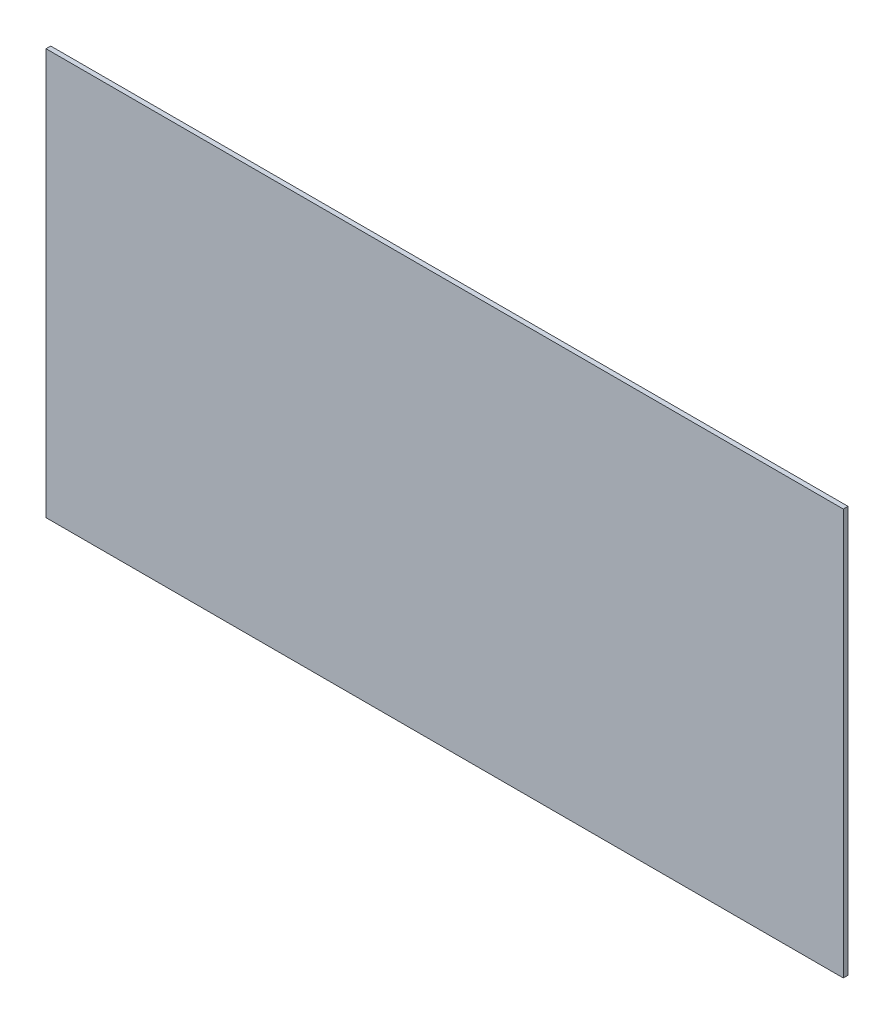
ISO-10303-21;
HEADER;
FILE_DESCRIPTION(('STEP AP214'),'2;1');
FILE_NAME('part.step','',(''),(''),'','','');
FILE_SCHEMA(('AUTOMOTIVE_DESIGN { 1 0 10303 214 1 1 1 1 }'));
ENDSEC;
DATA;
#1=APPLICATION_CONTEXT('core data for automotive mechanical design processes');
#2=APPLICATION_PROTOCOL_DEFINITION('international standard','automotive_design',2000,#1);
#3=PRODUCT_CONTEXT('',#1,'mechanical');
#4=PRODUCT('Part','Part','',(#3));
#5=PRODUCT_RELATED_PRODUCT_CATEGORY('part','',(#4));
#6=PRODUCT_DEFINITION_FORMATION('','',#4);
#7=PRODUCT_DEFINITION_CONTEXT('part definition',#1,'design');
#8=PRODUCT_DEFINITION('design','',#6,#7);
#9=PRODUCT_DEFINITION_SHAPE('','',#8);
#10=(LENGTH_UNIT() NAMED_UNIT(*) SI_UNIT(.MILLI.,.METRE.));
#11=(NAMED_UNIT(*) PLANE_ANGLE_UNIT() SI_UNIT($,.RADIAN.));
#12=(NAMED_UNIT(*) SI_UNIT($,.STERADIAN.) SOLID_ANGLE_UNIT());
#13=UNCERTAINTY_MEASURE_WITH_UNIT(LENGTH_MEASURE(1.E-05),#10,'distance_accuracy_value','');
#14=(GEOMETRIC_REPRESENTATION_CONTEXT(3) GLOBAL_UNCERTAINTY_ASSIGNED_CONTEXT((#13)) GLOBAL_UNIT_ASSIGNED_CONTEXT((#10,
#11,#12)) REPRESENTATION_CONTEXT('',''));
#15=CARTESIAN_POINT('',(0.,0.,0.));
#16=DIRECTION('',(0.,0.,1.));
#17=DIRECTION('',(1.,0.,0.));
#18=AXIS2_PLACEMENT_3D('',#15,#16,#17);
#19=CARTESIAN_POINT('',(-254.8,-129.8,3.));
#20=DIRECTION('',(0.,1.,0.));
#21=DIRECTION('',(0.,0.,1.));
#22=AXIS2_PLACEMENT_3D('',#19,#20,#21);
#23=PLANE('',#22);
#24=DIRECTION('',(1.,0.,0.));
#25=VECTOR('',#24,1.);
#26=CARTESIAN_POINT('',(-254.8,-129.8,0.));
#27=LINE('',#26,#25);
#28=CARTESIAN_POINT('',(-254.8,-129.8,0.));
#29=VERTEX_POINT('',#28);
#30=CARTESIAN_POINT('',(254.8,-129.8,0.));
#31=VERTEX_POINT('',#30);
#32=EDGE_CURVE('E96',#29,#31,#27,.T.);
#33=ORIENTED_EDGE('',*,*,#32,.T.);
#34=DIRECTION('',(0.,0.,-1.));
#35=VECTOR('',#34,1.);
#36=CARTESIAN_POINT('',(254.8,-129.8,3.));
#37=LINE('',#36,#35);
#38=CARTESIAN_POINT('',(254.8,-129.8,3.));
#39=VERTEX_POINT('',#38);
#40=EDGE_CURVE('E11',#39,#31,#37,.T.);
#41=ORIENTED_EDGE('',*,*,#40,.F.);
#42=DIRECTION('',(1.,0.,0.));
#43=VECTOR('',#42,1.);
#44=CARTESIAN_POINT('',(-254.8,-129.8,3.));
#45=LINE('',#44,#43);
#46=CARTESIAN_POINT('',(-254.8,-129.8,3.));
#47=VERTEX_POINT('',#46);
#48=EDGE_CURVE('E82',#47,#39,#45,.T.);
#49=ORIENTED_EDGE('',*,*,#48,.F.);
#50=DIRECTION('',(0.,0.,-1.));
#51=VECTOR('',#50,1.);
#52=CARTESIAN_POINT('',(-254.8,-129.8,3.));
#53=LINE('',#52,#51);
#54=EDGE_CURVE('E49',#47,#29,#53,.T.);
#55=ORIENTED_EDGE('',*,*,#54,.T.);
#56=EDGE_LOOP('',(#33,#41,#49,#55));
#57=FACE_BOUND('',#56,.T.);
#58=ADVANCED_FACE('F33',(#57),#23,.F.);
#59=CARTESIAN_POINT('',(254.8,-129.8,3.));
#60=DIRECTION('',(-1.,0.,0.));
#61=DIRECTION('',(0.,-1.,0.));
#62=AXIS2_PLACEMENT_3D('',#59,#60,#61);
#63=PLANE('',#62);
#64=DIRECTION('',(0.,1.,0.));
#65=VECTOR('',#64,1.);
#66=CARTESIAN_POINT('',(254.8,-129.8,0.));
#67=LINE('',#66,#65);
#68=CARTESIAN_POINT('',(254.8,129.8,0.));
#69=VERTEX_POINT('',#68);
#70=EDGE_CURVE('E87',#31,#69,#67,.T.);
#71=ORIENTED_EDGE('',*,*,#70,.T.);
#72=DIRECTION('',(0.,0.,-1.));
#73=VECTOR('',#72,1.);
#74=CARTESIAN_POINT('',(254.8,129.8,3.));
#75=LINE('',#74,#73);
#76=CARTESIAN_POINT('',(254.8,129.8,3.));
#77=VERTEX_POINT('',#76);
#78=EDGE_CURVE('E41',#77,#69,#75,.T.);
#79=ORIENTED_EDGE('',*,*,#78,.F.);
#80=DIRECTION('',(0.,1.,0.));
#81=VECTOR('',#80,1.);
#82=CARTESIAN_POINT('',(254.8,-129.8,3.));
#83=LINE('',#82,#81);
#84=EDGE_CURVE('E74',#39,#77,#83,.T.);
#85=ORIENTED_EDGE('',*,*,#84,.F.);
#86=ORIENTED_EDGE('',*,*,#40,.T.);
#87=EDGE_LOOP('',(#71,#79,#85,#86));
#88=FACE_BOUND('',#87,.T.);
#89=ADVANCED_FACE('F86',(#88),#63,.F.);
#90=CARTESIAN_POINT('',(-254.8,129.8,3.));
#91=DIRECTION('',(0.,1.,0.));
#92=DIRECTION('',(0.,0.,1.));
#93=AXIS2_PLACEMENT_3D('',#90,#91,#92);
#94=PLANE('',#93);
#95=DIRECTION('',(1.,0.,0.));
#96=VECTOR('',#95,1.);
#97=CARTESIAN_POINT('',(-254.8,129.8,0.));
#98=LINE('',#97,#96);
#99=CARTESIAN_POINT('',(-254.8,129.8,0.));
#100=VERTEX_POINT('',#99);
#101=EDGE_CURVE('E99',#100,#69,#98,.T.);
#102=ORIENTED_EDGE('',*,*,#101,.F.);
#103=DIRECTION('',(0.,0.,-1.));
#104=VECTOR('',#103,1.);
#105=CARTESIAN_POINT('',(-254.8,129.8,3.));
#106=LINE('',#105,#104);
#107=CARTESIAN_POINT('',(-254.8,129.8,3.));
#108=VERTEX_POINT('',#107);
#109=EDGE_CURVE('E63',#108,#100,#106,.T.);
#110=ORIENTED_EDGE('',*,*,#109,.F.);
#111=DIRECTION('',(1.,0.,0.));
#112=VECTOR('',#111,1.);
#113=CARTESIAN_POINT('',(-254.8,129.8,3.));
#114=LINE('',#113,#112);
#115=EDGE_CURVE('E81',#108,#77,#114,.T.);
#116=ORIENTED_EDGE('',*,*,#115,.T.);
#117=ORIENTED_EDGE('',*,*,#78,.T.);
#118=EDGE_LOOP('',(#102,#110,#116,#117));
#119=FACE_BOUND('',#118,.T.);
#120=ADVANCED_FACE('F90',(#119),#94,.T.);
#121=CARTESIAN_POINT('',(-254.8,-129.8,3.));
#122=DIRECTION('',(-1.,0.,0.));
#123=DIRECTION('',(0.,0.,1.));
#124=AXIS2_PLACEMENT_3D('',#121,#122,#123);
#125=PLANE('',#124);
#126=DIRECTION('',(0.,1.,0.));
#127=VECTOR('',#126,1.);
#128=CARTESIAN_POINT('',(-254.8,-129.8,0.));
#129=LINE('',#128,#127);
#130=EDGE_CURVE('E101',#29,#100,#129,.T.);
#131=ORIENTED_EDGE('',*,*,#130,.F.);
#132=ORIENTED_EDGE('',*,*,#54,.F.);
#133=DIRECTION('',(0.,1.,0.));
#134=VECTOR('',#133,1.);
#135=CARTESIAN_POINT('',(-254.8,-129.8,3.));
#136=LINE('',#135,#134);
#137=EDGE_CURVE('E91',#47,#108,#136,.T.);
#138=ORIENTED_EDGE('',*,*,#137,.T.);
#139=ORIENTED_EDGE('',*,*,#109,.T.);
#140=EDGE_LOOP('',(#131,#132,#138,#139));
#141=FACE_BOUND('',#140,.T.);
#142=ADVANCED_FACE('F107',(#141),#125,.T.);
#143=CARTESIAN_POINT('',(0.,0.,3.));
#144=DIRECTION('',(0.,0.,1.));
#145=DIRECTION('',(1.,0.,0.));
#146=AXIS2_PLACEMENT_3D('',#143,#144,#145);
#147=PLANE('',#146);
#148=ORIENTED_EDGE('',*,*,#48,.T.);
#149=ORIENTED_EDGE('',*,*,#84,.T.);
#150=ORIENTED_EDGE('',*,*,#115,.F.);
#151=ORIENTED_EDGE('',*,*,#137,.F.);
#152=EDGE_LOOP('',(#148,#149,#150,#151));
#153=FACE_BOUND('',#152,.T.);
#154=ADVANCED_FACE('F78',(#153),#147,.T.);
#155=CARTESIAN_POINT('',(0.,0.,0.));
#156=DIRECTION('',(0.,0.,1.));
#157=DIRECTION('',(1.,0.,0.));
#158=AXIS2_PLACEMENT_3D('',#155,#156,#157);
#159=PLANE('',#158);
#160=ORIENTED_EDGE('',*,*,#32,.F.);
#161=ORIENTED_EDGE('',*,*,#130,.T.);
#162=ORIENTED_EDGE('',*,*,#101,.T.);
#163=ORIENTED_EDGE('',*,*,#70,.F.);
#164=EDGE_LOOP('',(#160,#161,#162,#163));
#165=FACE_BOUND('',#164,.T.);
#166=ADVANCED_FACE('F106',(#165),#159,.F.);
#167=CLOSED_SHELL('',(#58,#89,#120,#142,#154,#166));
#168=MANIFOLD_SOLID_BREP('B2',#167);
#169=ADVANCED_BREP_SHAPE_REPRESENTATION('',(#18,#168),#14);
#170=SHAPE_DEFINITION_REPRESENTATION(#9,#169);
ENDSEC;
END-ISO-10303-21;
